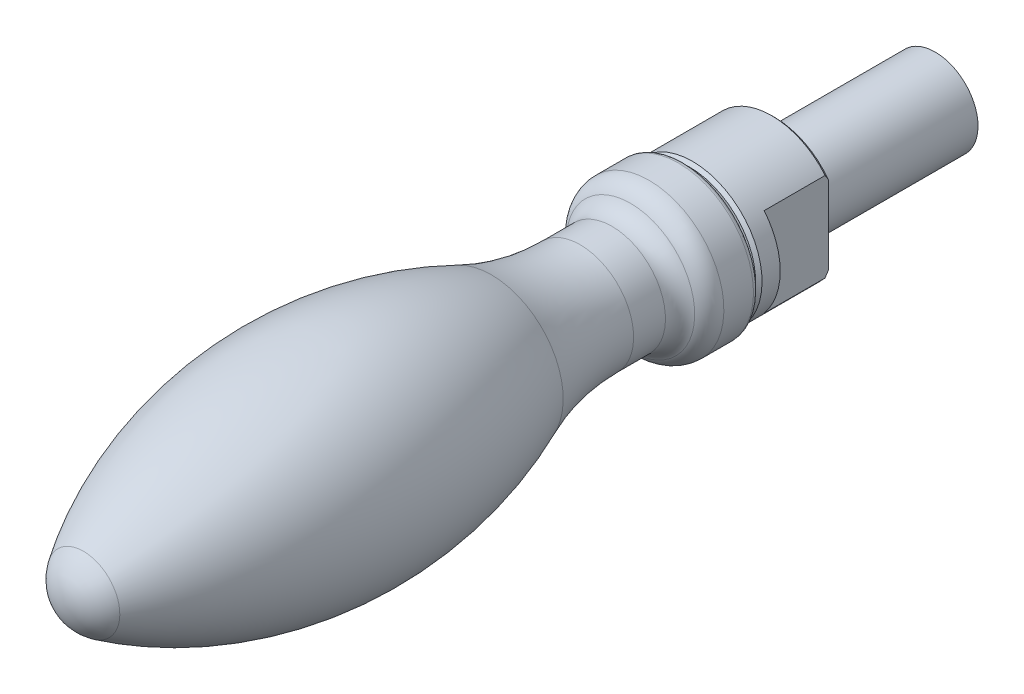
ISO-10303-21;
HEADER;
FILE_DESCRIPTION(('STEP AP214'),'2;1');
FILE_NAME('part.step','',(''),(''),'','','');
FILE_SCHEMA(('AUTOMOTIVE_DESIGN { 1 0 10303 214 1 1 1 1 }'));
ENDSEC;
DATA;
#1=APPLICATION_CONTEXT('core data for automotive mechanical design processes');
#2=APPLICATION_PROTOCOL_DEFINITION('international standard','automotive_design',2000,#1);
#3=PRODUCT_CONTEXT('',#1,'mechanical');
#4=PRODUCT('Part','Part','',(#3));
#5=PRODUCT_RELATED_PRODUCT_CATEGORY('part','',(#4));
#6=PRODUCT_DEFINITION_FORMATION('','',#4);
#7=PRODUCT_DEFINITION_CONTEXT('part definition',#1,'design');
#8=PRODUCT_DEFINITION('design','',#6,#7);
#9=PRODUCT_DEFINITION_SHAPE('','',#8);
#10=(LENGTH_UNIT() NAMED_UNIT(*) SI_UNIT(.MILLI.,.METRE.));
#11=(NAMED_UNIT(*) PLANE_ANGLE_UNIT() SI_UNIT($,.RADIAN.));
#12=(NAMED_UNIT(*) SI_UNIT($,.STERADIAN.) SOLID_ANGLE_UNIT());
#13=UNCERTAINTY_MEASURE_WITH_UNIT(LENGTH_MEASURE(1.E-05),#10,'distance_accuracy_value','');
#14=(GEOMETRIC_REPRESENTATION_CONTEXT(3) GLOBAL_UNCERTAINTY_ASSIGNED_CONTEXT((#13)) GLOBAL_UNIT_ASSIGNED_CONTEXT((#10,
#11,#12)) REPRESENTATION_CONTEXT('',''));
#15=CARTESIAN_POINT('',(0.,0.,0.));
#16=DIRECTION('',(0.,0.,1.));
#17=DIRECTION('',(1.,0.,0.));
#18=AXIS2_PLACEMENT_3D('',#15,#16,#17);
#19=CARTESIAN_POINT('',(0.,0.,-20.0000000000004));
#20=DIRECTION('',(0.,0.,-1.));
#21=DIRECTION('',(0.,1.,0.));
#22=AXIS2_PLACEMENT_3D('',#19,#20,#21);
#23=CYLINDRICAL_SURFACE('',#22,6.5);
#24=CARTESIAN_POINT('',(0.,0.,7.69999999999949));
#25=DIRECTION('',(0.,0.,-1.));
#26=DIRECTION('',(0.,1.,0.));
#27=AXIS2_PLACEMENT_3D('',#24,#25,#26);
#28=CIRCLE('',#27,6.5);
#29=CARTESIAN_POINT('',(0.,6.49999999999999,7.6999999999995));
#30=VERTEX_POINT('',#29);
#31=EDGE_CURVE('E224',#30,#30,#28,.T.);
#32=ORIENTED_EDGE('',*,*,#31,.T.);
#33=EDGE_LOOP('',(#32));
#34=FACE_BOUND('',#33,.T.);
#35=CARTESIAN_POINT('',(0.,0.,0.299999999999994));
#36=DIRECTION('',(0.,0.,-1.));
#37=DIRECTION('',(0.,1.,0.));
#38=AXIS2_PLACEMENT_3D('',#35,#36,#37);
#39=CIRCLE('',#38,6.5);
#40=CARTESIAN_POINT('',(-5.,4.15331193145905,0.299999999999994));
#41=VERTEX_POINT('',#40);
#42=CARTESIAN_POINT('',(5.,4.15331193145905,0.299999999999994));
#43=VERTEX_POINT('',#42);
#44=EDGE_CURVE('E84',#41,#43,#39,.T.);
#45=ORIENTED_EDGE('',*,*,#44,.F.);
#46=DIRECTION('',(0.,0.,-1.));
#47=VECTOR('',#46,1.);
#48=CARTESIAN_POINT('',(-5.,4.15331193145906,-20.0000000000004));
#49=LINE('',#48,#47);
#50=CARTESIAN_POINT('',(-5.,4.15331193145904,6.));
#51=VERTEX_POINT('',#50);
#52=EDGE_CURVE('E77',#41,#51,#49,.F.);
#53=ORIENTED_EDGE('',*,*,#52,.T.);
#54=CARTESIAN_POINT('',(0.,0.,6.));
#55=DIRECTION('',(0.,0.,1.));
#56=DIRECTION('',(0.,-1.,0.));
#57=AXIS2_PLACEMENT_3D('',#54,#55,#56);
#58=CIRCLE('',#57,6.5);
#59=CARTESIAN_POINT('',(-5.,-4.15331193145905,6.));
#60=VERTEX_POINT('',#59);
#61=EDGE_CURVE('E9',#60,#51,#58,.F.);
#62=ORIENTED_EDGE('',*,*,#61,.F.);
#63=DIRECTION('',(0.,0.,-1.));
#64=VECTOR('',#63,1.);
#65=CARTESIAN_POINT('',(-5.,-4.15331193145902,-20.0000000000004));
#66=LINE('',#65,#64);
#67=CARTESIAN_POINT('',(-5.,-4.15331193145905,0.299999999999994));
#68=VERTEX_POINT('',#67);
#69=EDGE_CURVE('E66',#60,#68,#66,.T.);
#70=ORIENTED_EDGE('',*,*,#69,.T.);
#71=CARTESIAN_POINT('',(5.,-4.15331193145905,0.299999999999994));
#72=VERTEX_POINT('',#71);
#73=EDGE_CURVE('E222',#72,#68,#39,.T.);
#74=ORIENTED_EDGE('',*,*,#73,.F.);
#75=DIRECTION('',(0.,0.,-1.));
#76=VECTOR('',#75,1.);
#77=CARTESIAN_POINT('',(5.,-4.15331193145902,-20.0000000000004));
#78=LINE('',#77,#76);
#79=CARTESIAN_POINT('',(5.,-4.15331193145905,6.));
#80=VERTEX_POINT('',#79);
#81=EDGE_CURVE('E239',#80,#72,#78,.T.);
#82=ORIENTED_EDGE('',*,*,#81,.F.);
#83=CARTESIAN_POINT('',(0.,0.,6.));
#84=DIRECTION('',(0.,0.,-1.));
#85=DIRECTION('',(0.,1.,0.));
#86=AXIS2_PLACEMENT_3D('',#83,#84,#85);
#87=CIRCLE('',#86,6.5);
#88=CARTESIAN_POINT('',(5.,4.15331193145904,6.));
#89=VERTEX_POINT('',#88);
#90=EDGE_CURVE('E202',#80,#89,#87,.F.);
#91=ORIENTED_EDGE('',*,*,#90,.T.);
#92=DIRECTION('',(0.,0.,-1.));
#93=VECTOR('',#92,1.);
#94=CARTESIAN_POINT('',(5.,4.15331193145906,-20.0000000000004));
#95=LINE('',#94,#93);
#96=EDGE_CURVE('E236',#43,#89,#95,.F.);
#97=ORIENTED_EDGE('',*,*,#96,.F.);
#98=EDGE_LOOP('',(#45,#53,#62,#70,#74,#82,#91,#97));
#99=FACE_BOUND('',#98,.T.);
#100=ADVANCED_FACE('F14',(#34,#99),#23,.T.);
#101=CARTESIAN_POINT('',(0.,0.,0.299999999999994));
#102=DIRECTION('',(0.,0.,1.));
#103=DIRECTION('',(0.,-1.,0.));
#104=AXIS2_PLACEMENT_3D('',#101,#102,#103);
#105=CONICAL_SURFACE('',#104,6.5,0.785398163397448);
#106=CARTESIAN_POINT('',(-5.,-1.41733011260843,-1.0029984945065));
#107=CARTESIAN_POINT('',(-5.,-1.5232809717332,-0.974105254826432));
#108=CARTESIAN_POINT('',(-5.,-1.62843384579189,-0.942427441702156));
#109=CARTESIAN_POINT('',(-5.,-1.83705617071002,-0.874112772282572));
#110=CARTESIAN_POINT('',(-5.,-1.94052652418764,-0.837478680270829));
#111=CARTESIAN_POINT('',(-5.,-2.24783021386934,-0.721240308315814));
#112=CARTESIAN_POINT('',(-5.,-2.44920407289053,-0.635116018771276));
#113=CARTESIAN_POINT('',(-5.,-2.84414976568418,-0.450309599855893));
#114=CARTESIAN_POINT('',(-5.,-3.03776846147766,-0.351725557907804));
#115=CARTESIAN_POINT('',(-5.,-3.41972953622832,-0.144523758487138));
#116=CARTESIAN_POINT('',(-5.,-3.60806738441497,-0.0358977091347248));
#117=CARTESIAN_POINT('',(-5.,-3.92476406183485,0.155545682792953));
#118=CARTESIAN_POINT('',(-5.,-4.05430320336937,0.236431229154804));
#119=CARTESIAN_POINT('',(-5.,-4.31135351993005,0.401368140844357));
#120=CARTESIAN_POINT('',(-5.,-4.43886462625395,0.485419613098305));
#121=CARTESIAN_POINT('',(-5.,-4.81878578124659,0.741583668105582));
#122=CARTESIAN_POINT('',(-5.,-5.06851875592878,0.917665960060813));
#123=CARTESIAN_POINT('',(-5.,-5.56272233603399,1.27765134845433));
#124=CARTESIAN_POINT('',(-5.,-5.80718574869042,1.46156422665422));
#125=CARTESIAN_POINT('',(-5.,-6.29174887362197,1.83506658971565));
#126=CARTESIAN_POINT('',(-5.,-6.53184829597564,2.02465644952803));
#127=CARTESIAN_POINT('',(-5.,-7.01412459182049,2.41260494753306));
#128=CARTESIAN_POINT('',(-5.,-7.25621963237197,2.61106497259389));
#129=CARTESIAN_POINT('',(-5.,-7.7375180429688,3.01148117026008));
#130=CARTESIAN_POINT('',(-5.,-7.97672124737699,3.21343754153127));
#131=CARTESIAN_POINT('',(-5.,-8.45178856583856,3.61924128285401));
#132=CARTESIAN_POINT('',(-5.,-8.6876624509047,3.82307723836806));
#133=CARTESIAN_POINT('',(-5.,-9.15745530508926,4.23292988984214));
#134=CARTESIAN_POINT('',(-5.,-9.39137452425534,4.43894629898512));
#135=CARTESIAN_POINT('',(-5.,-9.62453243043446,4.64581138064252));
#136=B_SPLINE_CURVE_WITH_KNOTS('',3,(#106,#107,#108,#109,#110,#111,#112,#113,#114,#115,#116,
#117,#118,#119,#120,#121,#122,#123,#124,#125,#126,#127,#128,#129,#130,#131,#132,#133,#134,#135),
.UNSPECIFIED.,.F.,.F.,(4,2,2,2,2,2,2,2,2,2,2,2,2,2,4),(0.,0.329363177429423,0.658543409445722,
1.31489081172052,1.96636021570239,2.61837243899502,3.07648154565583,3.5346061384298,
4.45108374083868,5.3687418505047,6.28646070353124,7.22555132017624,8.16469547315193,
9.09991885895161,10.0350207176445),.UNSPECIFIED.);
#137=CARTESIAN_POINT('',(-5.,-3.66606055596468,0.));
#138=VERTEX_POINT('',#137);
#139=EDGE_CURVE('E72',#138,#68,#136,.T.);
#140=ORIENTED_EDGE('',*,*,#139,.F.);
#141=CARTESIAN_POINT('',(0.,0.,0.));
#142=DIRECTION('',(0.,0.,-1.));
#143=DIRECTION('',(0.,1.,0.));
#144=AXIS2_PLACEMENT_3D('',#141,#142,#143);
#145=CIRCLE('',#144,6.2);
#146=CARTESIAN_POINT('',(5.,-3.66606055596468,0.));
#147=VERTEX_POINT('',#146);
#148=EDGE_CURVE('E213',#147,#138,#145,.T.);
#149=ORIENTED_EDGE('',*,*,#148,.F.);
#150=CARTESIAN_POINT('',(5.,-1.41733011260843,-1.0029984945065));
#151=CARTESIAN_POINT('',(5.,-1.5232809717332,-0.974105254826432));
#152=CARTESIAN_POINT('',(5.,-1.62843384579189,-0.942427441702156));
#153=CARTESIAN_POINT('',(5.,-1.83705617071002,-0.874112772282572));
#154=CARTESIAN_POINT('',(5.,-1.94052652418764,-0.837478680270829));
#155=CARTESIAN_POINT('',(5.,-2.24783021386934,-0.721240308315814));
#156=CARTESIAN_POINT('',(5.,-2.44920407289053,-0.635116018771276));
#157=CARTESIAN_POINT('',(5.,-2.84414976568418,-0.450309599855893));
#158=CARTESIAN_POINT('',(5.,-3.03776846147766,-0.351725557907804));
#159=CARTESIAN_POINT('',(5.,-3.41972953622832,-0.144523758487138));
#160=CARTESIAN_POINT('',(5.,-3.60806738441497,-0.0358977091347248));
#161=CARTESIAN_POINT('',(5.,-3.92476406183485,0.155545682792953));
#162=CARTESIAN_POINT('',(5.,-4.05430320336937,0.236431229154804));
#163=CARTESIAN_POINT('',(5.,-4.31135351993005,0.401368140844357));
#164=CARTESIAN_POINT('',(5.,-4.43886462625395,0.485419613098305));
#165=CARTESIAN_POINT('',(5.,-4.81878578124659,0.741583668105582));
#166=CARTESIAN_POINT('',(5.,-5.06851875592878,0.917665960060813));
#167=CARTESIAN_POINT('',(5.,-5.56272233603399,1.27765134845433));
#168=CARTESIAN_POINT('',(5.,-5.80718574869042,1.46156422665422));
#169=CARTESIAN_POINT('',(5.,-6.29174887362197,1.83506658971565));
#170=CARTESIAN_POINT('',(5.,-6.53184829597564,2.02465644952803));
#171=CARTESIAN_POINT('',(5.,-7.01412459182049,2.41260494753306));
#172=CARTESIAN_POINT('',(5.,-7.25621963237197,2.61106497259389));
#173=CARTESIAN_POINT('',(5.,-7.7375180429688,3.01148117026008));
#174=CARTESIAN_POINT('',(5.,-7.97672124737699,3.21343754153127));
#175=CARTESIAN_POINT('',(5.,-8.45178856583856,3.61924128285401));
#176=CARTESIAN_POINT('',(5.,-8.6876624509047,3.82307723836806));
#177=CARTESIAN_POINT('',(5.,-9.15745530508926,4.23292988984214));
#178=CARTESIAN_POINT('',(5.,-9.39137452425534,4.43894629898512));
#179=CARTESIAN_POINT('',(5.,-9.62453243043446,4.64581138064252));
#180=B_SPLINE_CURVE_WITH_KNOTS('',3,(#150,#151,#152,#153,#154,#155,#156,#157,#158,#159,#160,
#161,#162,#163,#164,#165,#166,#167,#168,#169,#170,#171,#172,#173,#174,#175,#176,#177,#178,#179),
.UNSPECIFIED.,.F.,.F.,(4,2,2,2,2,2,2,2,2,2,2,2,2,2,4),(0.,0.329363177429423,0.658543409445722,
1.31489081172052,1.96636021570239,2.61837243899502,3.07648154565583,3.5346061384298,
4.45108374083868,5.3687418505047,6.28646070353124,7.22555132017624,8.16469547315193,
9.09991885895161,10.0350207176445),.UNSPECIFIED.);
#181=EDGE_CURVE('E37',#147,#72,#180,.T.);
#182=ORIENTED_EDGE('',*,*,#181,.T.);
#183=ORIENTED_EDGE('',*,*,#73,.T.);
#184=EDGE_LOOP('',(#140,#149,#182,#183));
#185=FACE_BOUND('',#184,.T.);
#186=ADVANCED_FACE('F105',(#185),#105,.T.);
#187=CARTESIAN_POINT('',(-5.,9.62453243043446,4.64581138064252));
#188=CARTESIAN_POINT('',(-5.,9.39137452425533,4.43894629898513));
#189=CARTESIAN_POINT('',(-5.,9.15745530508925,4.23292988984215));
#190=CARTESIAN_POINT('',(-5.,8.68766245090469,3.82307723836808));
#191=CARTESIAN_POINT('',(-5.,8.45178856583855,3.61924128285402));
#192=CARTESIAN_POINT('',(-5.,7.97672124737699,3.21343754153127));
#193=CARTESIAN_POINT('',(-5.,7.7375180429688,3.01148117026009));
#194=CARTESIAN_POINT('',(-5.,7.25621963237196,2.61106497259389));
#195=CARTESIAN_POINT('',(-5.,7.01412459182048,2.41260494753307));
#196=CARTESIAN_POINT('',(-5.,6.53184829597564,2.02465644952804));
#197=CARTESIAN_POINT('',(-5.,6.29174887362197,1.83506658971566));
#198=CARTESIAN_POINT('',(-5.,5.80718574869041,1.46156422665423));
#199=CARTESIAN_POINT('',(-5.,5.56272233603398,1.27765134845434));
#200=CARTESIAN_POINT('',(-5.,5.06851875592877,0.917665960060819));
#201=CARTESIAN_POINT('',(-5.,4.81878578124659,0.741583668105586));
#202=CARTESIAN_POINT('',(-5.,4.43886462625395,0.48541961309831));
#203=CARTESIAN_POINT('',(-5.,4.31135351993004,0.401368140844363));
#204=CARTESIAN_POINT('',(-5.,4.05430320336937,0.236431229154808));
#205=CARTESIAN_POINT('',(-5.,3.92476406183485,0.155545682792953));
#206=CARTESIAN_POINT('',(-5.,3.60806738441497,-0.0358977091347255));
#207=CARTESIAN_POINT('',(-5.,3.41972953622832,-0.144523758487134));
#208=CARTESIAN_POINT('',(-5.,3.03776846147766,-0.351725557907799));
#209=CARTESIAN_POINT('',(-5.,2.84414976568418,-0.450309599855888));
#210=CARTESIAN_POINT('',(-5.,2.44920407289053,-0.635116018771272));
#211=CARTESIAN_POINT('',(-5.,2.24783021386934,-0.72124030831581));
#212=CARTESIAN_POINT('',(-5.,1.94052652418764,-0.837478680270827));
#213=CARTESIAN_POINT('',(-5.,1.83705617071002,-0.87411277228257));
#214=CARTESIAN_POINT('',(-5.,1.62843384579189,-0.942427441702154));
#215=CARTESIAN_POINT('',(-5.,1.52328097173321,-0.974105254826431));
#216=CARTESIAN_POINT('',(-5.,1.41733011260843,-1.0029984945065));
#217=B_SPLINE_CURVE_WITH_KNOTS('',3,(#187,#188,#189,#190,#191,#192,#193,#194,#195,#196,#197,
#198,#199,#200,#201,#202,#203,#204,#205,#206,#207,#208,#209,#210,#211,#212,#213,#214,#215,#216),
.UNSPECIFIED.,.F.,.F.,(4,2,2,2,2,2,2,2,2,2,2,2,2,2,4),(0.,0.935101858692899,1.87032524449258,
2.80946939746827,3.74856001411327,4.66627886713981,5.58393697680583,6.5004145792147,
6.95853917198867,7.41664827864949,8.06866050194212,8.72012990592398,9.37647730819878,
9.70565754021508,10.0350207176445),.UNSPECIFIED.);
#218=CARTESIAN_POINT('',(-5.,3.66606055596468,0.));
#219=VERTEX_POINT('',#218);
#220=EDGE_CURVE('E29',#41,#219,#217,.T.);
#221=ORIENTED_EDGE('',*,*,#220,.F.);
#222=ORIENTED_EDGE('',*,*,#44,.T.);
#223=CARTESIAN_POINT('',(5.,9.62453243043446,4.64581138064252));
#224=CARTESIAN_POINT('',(5.,9.39137452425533,4.43894629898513));
#225=CARTESIAN_POINT('',(5.,9.15745530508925,4.23292988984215));
#226=CARTESIAN_POINT('',(5.,8.68766245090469,3.82307723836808));
#227=CARTESIAN_POINT('',(5.,8.45178856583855,3.61924128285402));
#228=CARTESIAN_POINT('',(5.,7.97672124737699,3.21343754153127));
#229=CARTESIAN_POINT('',(5.,7.7375180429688,3.01148117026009));
#230=CARTESIAN_POINT('',(5.,7.25621963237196,2.61106497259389));
#231=CARTESIAN_POINT('',(5.,7.01412459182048,2.41260494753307));
#232=CARTESIAN_POINT('',(5.,6.53184829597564,2.02465644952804));
#233=CARTESIAN_POINT('',(5.,6.29174887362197,1.83506658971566));
#234=CARTESIAN_POINT('',(5.,5.80718574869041,1.46156422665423));
#235=CARTESIAN_POINT('',(5.,5.56272233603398,1.27765134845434));
#236=CARTESIAN_POINT('',(5.,5.06851875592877,0.917665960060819));
#237=CARTESIAN_POINT('',(5.,4.81878578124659,0.741583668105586));
#238=CARTESIAN_POINT('',(5.,4.43886462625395,0.48541961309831));
#239=CARTESIAN_POINT('',(5.,4.31135351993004,0.401368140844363));
#240=CARTESIAN_POINT('',(5.,4.05430320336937,0.236431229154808));
#241=CARTESIAN_POINT('',(5.,3.92476406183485,0.155545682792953));
#242=CARTESIAN_POINT('',(5.,3.60806738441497,-0.0358977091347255));
#243=CARTESIAN_POINT('',(5.,3.41972953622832,-0.144523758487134));
#244=CARTESIAN_POINT('',(5.,3.03776846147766,-0.351725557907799));
#245=CARTESIAN_POINT('',(5.,2.84414976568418,-0.450309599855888));
#246=CARTESIAN_POINT('',(5.,2.44920407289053,-0.635116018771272));
#247=CARTESIAN_POINT('',(5.,2.24783021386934,-0.72124030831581));
#248=CARTESIAN_POINT('',(5.,1.94052652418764,-0.837478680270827));
#249=CARTESIAN_POINT('',(5.,1.83705617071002,-0.87411277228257));
#250=CARTESIAN_POINT('',(5.,1.62843384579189,-0.942427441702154));
#251=CARTESIAN_POINT('',(5.,1.52328097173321,-0.974105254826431));
#252=CARTESIAN_POINT('',(5.,1.41733011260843,-1.0029984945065));
#253=B_SPLINE_CURVE_WITH_KNOTS('',3,(#223,#224,#225,#226,#227,#228,#229,#230,#231,#232,#233,
#234,#235,#236,#237,#238,#239,#240,#241,#242,#243,#244,#245,#246,#247,#248,#249,#250,#251,#252),
.UNSPECIFIED.,.F.,.F.,(4,2,2,2,2,2,2,2,2,2,2,2,2,2,4),(0.,0.935101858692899,1.87032524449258,
2.80946939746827,3.74856001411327,4.66627886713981,5.58393697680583,6.5004145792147,
6.95853917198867,7.41664827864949,8.06866050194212,8.72012990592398,9.37647730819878,
9.70565754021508,10.0350207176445),.UNSPECIFIED.);
#254=CARTESIAN_POINT('',(5.,3.66606055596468,0.));
#255=VERTEX_POINT('',#254);
#256=EDGE_CURVE('E88',#43,#255,#253,.T.);
#257=ORIENTED_EDGE('',*,*,#256,.T.);
#258=EDGE_CURVE('E211',#219,#255,#145,.T.);
#259=ORIENTED_EDGE('',*,*,#258,.F.);
#260=EDGE_LOOP('',(#221,#222,#257,#259));
#261=FACE_BOUND('',#260,.T.);
#262=ADVANCED_FACE('F159',(#261),#105,.T.);
#263=CARTESIAN_POINT('',(4.,0.,0.));
#264=DIRECTION('',(0.,0.,-1.));
#265=DIRECTION('',(0.,1.,0.));
#266=AXIS2_PLACEMENT_3D('',#263,#264,#265);
#267=PLANE('',#266);
#268=CARTESIAN_POINT('',(0.,0.,0.));
#269=DIRECTION('',(0.,0.,-1.));
#270=DIRECTION('',(0.,1.,0.));
#271=AXIS2_PLACEMENT_3D('',#268,#269,#270);
#272=CIRCLE('',#271,4.);
#273=CARTESIAN_POINT('',(0.,4.,0.));
#274=VERTEX_POINT('',#273);
#275=EDGE_CURVE('E215',#274,#274,#272,.T.);
#276=ORIENTED_EDGE('',*,*,#275,.F.);
#277=EDGE_LOOP('',(#276));
#278=FACE_BOUND('',#277,.T.);
#279=ORIENTED_EDGE('',*,*,#148,.T.);
#280=DIRECTION('',(0.,1.,0.));
#281=VECTOR('',#280,1.);
#282=CARTESIAN_POINT('',(-5.,0.,0.));
#283=LINE('',#282,#281);
#284=EDGE_CURVE('E22',#138,#219,#283,.T.);
#285=ORIENTED_EDGE('',*,*,#284,.T.);
#286=ORIENTED_EDGE('',*,*,#258,.T.);
#287=DIRECTION('',(0.,1.,0.));
#288=VECTOR('',#287,1.);
#289=CARTESIAN_POINT('',(5.,0.,0.));
#290=LINE('',#289,#288);
#291=EDGE_CURVE('E200',#147,#255,#290,.T.);
#292=ORIENTED_EDGE('',*,*,#291,.F.);
#293=EDGE_LOOP('',(#279,#285,#286,#292));
#294=FACE_BOUND('',#293,.T.);
#295=ADVANCED_FACE('F157',(#278,#294),#267,.T.);
#296=CARTESIAN_POINT('',(0.,0.,8.99999999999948));
#297=DIRECTION('',(0.,0.,-1.));
#298=DIRECTION('',(0.,1.,0.));
#299=AXIS2_PLACEMENT_3D('',#296,#297,#298);
#300=TOROIDAL_SURFACE('',#299,6.5,0.5);
#301=CARTESIAN_POINT('',(0.,0.,8.49999999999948));
#302=DIRECTION('',(0.,0.,-1.));
#303=DIRECTION('',(0.,1.,0.));
#304=AXIS2_PLACEMENT_3D('',#301,#302,#303);
#305=CIRCLE('',#304,6.5);
#306=CARTESIAN_POINT('',(0.,6.49999999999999,8.49999999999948));
#307=VERTEX_POINT('',#306);
#308=EDGE_CURVE('E199',#307,#307,#305,.T.);
#309=ORIENTED_EDGE('',*,*,#308,.F.);
#310=EDGE_LOOP('',(#309));
#311=FACE_BOUND('',#310,.T.);
#312=CARTESIAN_POINT('',(0.,0.,8.99999999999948));
#313=DIRECTION('',(0.,0.,-1.));
#314=DIRECTION('',(0.,1.,0.));
#315=AXIS2_PLACEMENT_3D('',#312,#313,#314);
#316=CIRCLE('',#315,7.);
#317=CARTESIAN_POINT('',(0.,6.99999999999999,8.99999999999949));
#318=VERTEX_POINT('',#317);
#319=EDGE_CURVE('E238',#318,#318,#316,.T.);
#320=ORIENTED_EDGE('',*,*,#319,.T.);
#321=EDGE_LOOP('',(#320));
#322=FACE_BOUND('',#321,.T.);
#323=ADVANCED_FACE('F16',(#311,#322),#300,.T.);
#324=CARTESIAN_POINT('',(6.5,0.,8.49999999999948));
#325=DIRECTION('',(0.,0.,1.));
#326=DIRECTION('',(0.,-1.,0.));
#327=AXIS2_PLACEMENT_3D('',#324,#325,#326);
#328=PLANE('',#327);
#329=CARTESIAN_POINT('',(0.,0.,8.50000000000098));
#330=DIRECTION('',(0.,0.,-1.));
#331=DIRECTION('',(0.,1.,0.));
#332=AXIS2_PLACEMENT_3D('',#329,#330,#331);
#333=CIRCLE('',#332,2.91270166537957);
#334=CARTESIAN_POINT('',(0.,2.91270166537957,8.50000000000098));
#335=VERTEX_POINT('',#334);
#336=EDGE_CURVE('E196',#335,#335,#333,.T.);
#337=ORIENTED_EDGE('',*,*,#336,.F.);
#338=EDGE_LOOP('',(#337));
#339=FACE_BOUND('',#338,.T.);
#340=ORIENTED_EDGE('',*,*,#308,.T.);
#341=EDGE_LOOP('',(#340));
#342=FACE_BOUND('',#341,.T.);
#343=ADVANCED_FACE('F166',(#339,#342),#328,.F.);
#344=CARTESIAN_POINT('',(0.,0.,8.39999999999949));
#345=DIRECTION('',(0.,0.,-1.));
#346=DIRECTION('',(0.,1.,0.));
#347=AXIS2_PLACEMENT_3D('',#344,#345,#346);
#348=TOROIDAL_SURFACE('',#347,3.3,0.4);
#349=ORIENTED_EDGE('',*,*,#336,.T.);
#350=EDGE_LOOP('',(#349));
#351=FACE_BOUND('',#350,.T.);
#352=CARTESIAN_POINT('',(0.,0.,7.99999999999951));
#353=DIRECTION('',(0.,0.,-1.));
#354=DIRECTION('',(0.,1.,0.));
#355=AXIS2_PLACEMENT_3D('',#352,#353,#354);
#356=CIRCLE('',#355,3.3);
#357=CARTESIAN_POINT('',(0.,3.29999999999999,7.99999999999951));
#358=VERTEX_POINT('',#357);
#359=EDGE_CURVE('E204',#358,#358,#356,.T.);
#360=ORIENTED_EDGE('',*,*,#359,.F.);
#361=EDGE_LOOP('',(#360));
#362=FACE_BOUND('',#361,.T.);
#363=ADVANCED_FACE('F185',(#351,#362),#348,.F.);
#364=CARTESIAN_POINT('',(3.3,0.,7.99999999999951));
#365=DIRECTION('',(0.,0.,-1.));
#366=DIRECTION('',(0.,1.,0.));
#367=AXIS2_PLACEMENT_3D('',#364,#365,#366);
#368=PLANE('',#367);
#369=CARTESIAN_POINT('',(0.,0.,8.));
#370=DIRECTION('',(0.,0.,-1.));
#371=DIRECTION('',(0.,1.,0.));
#372=AXIS2_PLACEMENT_3D('',#369,#370,#371);
#373=CIRCLE('',#372,6.2);
#374=CARTESIAN_POINT('',(0.,6.19999999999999,8.00000000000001));
#375=VERTEX_POINT('',#374);
#376=EDGE_CURVE('E226',#375,#375,#373,.T.);
#377=ORIENTED_EDGE('',*,*,#376,.F.);
#378=EDGE_LOOP('',(#377));
#379=FACE_BOUND('',#378,.T.);
#380=ORIENTED_EDGE('',*,*,#359,.T.);
#381=EDGE_LOOP('',(#380));
#382=FACE_BOUND('',#381,.T.);
#383=ADVANCED_FACE('F181',(#379,#382),#368,.F.);
#384=CARTESIAN_POINT('',(0.,0.,7.69999999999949));
#385=DIRECTION('',(0.,0.,-1.));
#386=DIRECTION('',(0.,1.,0.));
#387=AXIS2_PLACEMENT_3D('',#384,#385,#386);
#388=CONICAL_SURFACE('',#387,6.5,0.785398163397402);
#389=ORIENTED_EDGE('',*,*,#376,.T.);
#390=EDGE_LOOP('',(#389));
#391=FACE_BOUND('',#390,.T.);
#392=ORIENTED_EDGE('',*,*,#31,.F.);
#393=EDGE_LOOP('',(#392));
#394=FACE_BOUND('',#393,.T.);
#395=ADVANCED_FACE('F155',(#391,#394),#388,.T.);
#396=CARTESIAN_POINT('',(0.,0.,-20.0000000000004));
#397=DIRECTION('',(0.,0.,-1.));
#398=DIRECTION('',(0.,1.,0.));
#399=AXIS2_PLACEMENT_3D('',#396,#397,#398);
#400=CYLINDRICAL_SURFACE('',#399,4.);
#401=ORIENTED_EDGE('',*,*,#275,.T.);
#402=EDGE_LOOP('',(#401));
#403=FACE_BOUND('',#402,.T.);
#404=CARTESIAN_POINT('',(0.,0.,-15.));
#405=DIRECTION('',(0.,0.,-1.));
#406=DIRECTION('',(0.,1.,0.));
#407=AXIS2_PLACEMENT_3D('',#404,#405,#406);
#408=CIRCLE('',#407,4.);
#409=CARTESIAN_POINT('',(0.,4.00000000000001,-15.));
#410=VERTEX_POINT('',#409);
#411=EDGE_CURVE('E218',#410,#410,#408,.T.);
#412=ORIENTED_EDGE('',*,*,#411,.F.);
#413=EDGE_LOOP('',(#412));
#414=FACE_BOUND('',#413,.T.);
#415=ADVANCED_FACE('F152',(#403,#414),#400,.T.);
#416=CARTESIAN_POINT('',(0.,0.,-15.0000000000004));
#417=DIRECTION('',(0.,0.,-1.));
#418=DIRECTION('',(0.,1.,0.));
#419=AXIS2_PLACEMENT_3D('',#416,#417,#418);
#420=PLANE('',#419);
#421=ORIENTED_EDGE('',*,*,#411,.T.);
#422=EDGE_LOOP('',(#421));
#423=FACE_BOUND('',#422,.T.);
#424=ADVANCED_FACE('F148',(#423),#420,.T.);
#425=CARTESIAN_POINT('',(0.,0.,62.4393939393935));
#426=DIRECTION('',(0.,1.,0.));
#427=DIRECTION('',(0.,0.,1.));
#428=AXIS2_PLACEMENT_3D('',#425,#426,#427);
#429=SPHERICAL_SURFACE('',#428,4.06060606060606);
#430=CARTESIAN_POINT('',(0.,0.,62.4393939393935));
#431=DIRECTION('',(0.,0.,-1.));
#432=DIRECTION('',(0.,1.,0.));
#433=AXIS2_PLACEMENT_3D('',#430,#431,#432);
#434=SPHERICAL_SURFACE('',#433,4.06060606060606);
#435=CARTESIAN_POINT('',(0.,0.,64.6613305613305));
#436=DIRECTION('',(0.,0.,-1.));
#437=DIRECTION('',(0.,1.,0.));
#438=AXIS2_PLACEMENT_3D('',#435,#436,#437);
#439=CIRCLE('',#438,3.39875259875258);
#440=CARTESIAN_POINT('',(0.,3.39875259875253,64.6613305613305));
#441=VERTEX_POINT('',#440);
#442=EDGE_CURVE('E259',#441,#441,#439,.T.);
#443=ORIENTED_EDGE('',*,*,#442,.F.);
#444=EDGE_LOOP('',(#443));
#445=FACE_BOUND('',#444,.T.);
#446=ADVANCED_FACE('F144',(#445),#434,.T.);
#447=CARTESIAN_POINT('',(0.,0.,42.4999999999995));
#448=DIRECTION('',(0.,0.,-1.));
#449=DIRECTION('',(0.,1.,0.));
#450=AXIS2_PLACEMENT_3D('',#447,#448,#449);
#451=DEGENERATE_TOROIDAL_SURFACE('',#450,30.5,40.5,.F.);
#452=CARTESIAN_POINT('',(0.,0.,26.504201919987));
#453=DIRECTION('',(0.,0.,-1.));
#454=DIRECTION('',(0.,1.,0.));
#455=AXIS2_PLACEMENT_3D('',#452,#453,#454);
#456=CIRCLE('',#455,6.70731707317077);
#457=CARTESIAN_POINT('',(0.,6.70731707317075,26.504201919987));
#458=VERTEX_POINT('',#457);
#459=EDGE_CURVE('E256',#458,#458,#456,.T.);
#460=ORIENTED_EDGE('',*,*,#459,.F.);
#461=EDGE_LOOP('',(#460));
#462=FACE_BOUND('',#461,.T.);
#463=ORIENTED_EDGE('',*,*,#442,.T.);
#464=EDGE_LOOP('',(#463));
#465=FACE_BOUND('',#464,.T.);
#466=ADVANCED_FACE('F140',(#462,#465),#451,.F.);
#467=CARTESIAN_POINT('',(0.,0.,18.2100843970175));
#468=DIRECTION('',(0.,0.,-1.));
#469=DIRECTION('',(0.,1.,0.));
#470=AXIS2_PLACEMENT_3D('',#467,#468,#469);
#471=TOROIDAL_SURFACE('',#470,26.,21.);
#472=ORIENTED_EDGE('',*,*,#459,.T.);
#473=EDGE_LOOP('',(#472));
#474=FACE_BOUND('',#473,.T.);
#475=CARTESIAN_POINT('',(0.,0.,18.2100843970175));
#476=DIRECTION('',(0.,0.,-1.));
#477=DIRECTION('',(0.,1.,0.));
#478=AXIS2_PLACEMENT_3D('',#475,#476,#477);
#479=CIRCLE('',#478,5.00000000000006);
#480=CARTESIAN_POINT('',(0.,5.00000000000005,18.2100843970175));
#481=VERTEX_POINT('',#480);
#482=EDGE_CURVE('E253',#481,#481,#479,.T.);
#483=ORIENTED_EDGE('',*,*,#482,.F.);
#484=EDGE_LOOP('',(#483));
#485=FACE_BOUND('',#484,.T.);
#486=ADVANCED_FACE('F136',(#474,#485),#471,.F.);
#487=CARTESIAN_POINT('',(0.,0.,-20.0000000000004));
#488=DIRECTION('',(0.,0.,-1.));
#489=DIRECTION('',(0.,1.,0.));
#490=AXIS2_PLACEMENT_3D('',#487,#488,#489);
#491=CYLINDRICAL_SURFACE('',#490,5.);
#492=ORIENTED_EDGE('',*,*,#482,.T.);
#493=EDGE_LOOP('',(#492));
#494=FACE_BOUND('',#493,.T.);
#495=CARTESIAN_POINT('',(0.,0.,15.2320508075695));
#496=DIRECTION('',(0.,0.,-1.));
#497=DIRECTION('',(0.,1.,0.));
#498=AXIS2_PLACEMENT_3D('',#495,#496,#497);
#499=CIRCLE('',#498,5.);
#500=CARTESIAN_POINT('',(0.,4.99999999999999,15.2320508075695));
#501=VERTEX_POINT('',#500);
#502=EDGE_CURVE('E250',#501,#501,#499,.T.);
#503=ORIENTED_EDGE('',*,*,#502,.F.);
#504=EDGE_LOOP('',(#503));
#505=FACE_BOUND('',#504,.T.);
#506=ADVANCED_FACE('F132',(#494,#505),#491,.T.);
#507=CARTESIAN_POINT('',(0.,0.,15.2320508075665));
#508=DIRECTION('',(0.,0.,-1.));
#509=DIRECTION('',(0.,1.,0.));
#510=AXIS2_PLACEMENT_3D('',#507,#508,#509);
#511=TOROIDAL_SURFACE('',#510,7.,2.);
#512=ORIENTED_EDGE('',*,*,#502,.T.);
#513=EDGE_LOOP('',(#512));
#514=FACE_BOUND('',#513,.T.);
#515=CARTESIAN_POINT('',(0.,0.,13.5));
#516=DIRECTION('',(0.,0.,-1.));
#517=DIRECTION('',(0.,1.,0.));
#518=AXIS2_PLACEMENT_3D('',#515,#516,#517);
#519=CIRCLE('',#518,5.99999999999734);
#520=CARTESIAN_POINT('',(0.,5.99999999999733,13.5));
#521=VERTEX_POINT('',#520);
#522=EDGE_CURVE('E247',#521,#521,#519,.T.);
#523=ORIENTED_EDGE('',*,*,#522,.F.);
#524=EDGE_LOOP('',(#523));
#525=FACE_BOUND('',#524,.T.);
#526=ADVANCED_FACE('F128',(#514,#525),#511,.F.);
#527=CARTESIAN_POINT('',(0.,0.,11.7679491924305));
#528=DIRECTION('',(0.,0.,-1.));
#529=DIRECTION('',(0.,1.,0.));
#530=AXIS2_PLACEMENT_3D('',#527,#528,#529);
#531=TOROIDAL_SURFACE('',#530,5.,1.99999999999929);
#532=CARTESIAN_POINT('',(0.,0.,11.767949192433));
#533=DIRECTION('',(0.,0.,-1.));
#534=DIRECTION('',(0.,1.,0.));
#535=AXIS2_PLACEMENT_3D('',#532,#533,#534);
#536=CIRCLE('',#535,7.);
#537=CARTESIAN_POINT('',(0.,6.99999999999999,11.767949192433));
#538=VERTEX_POINT('',#537);
#539=EDGE_CURVE('E242',#538,#538,#536,.T.);
#540=ORIENTED_EDGE('',*,*,#539,.F.);
#541=EDGE_LOOP('',(#540));
#542=FACE_BOUND('',#541,.T.);
#543=ORIENTED_EDGE('',*,*,#522,.T.);
#544=EDGE_LOOP('',(#543));
#545=FACE_BOUND('',#544,.T.);
#546=ADVANCED_FACE('F124',(#542,#545),#531,.T.);
#547=CARTESIAN_POINT('',(0.,0.,-20.0000000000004));
#548=DIRECTION('',(0.,0.,-1.));
#549=DIRECTION('',(0.,1.,0.));
#550=AXIS2_PLACEMENT_3D('',#547,#548,#549);
#551=CYLINDRICAL_SURFACE('',#550,7.);
#552=ORIENTED_EDGE('',*,*,#539,.T.);
#553=EDGE_LOOP('',(#552));
#554=FACE_BOUND('',#553,.T.);
#555=ORIENTED_EDGE('',*,*,#319,.F.);
#556=EDGE_LOOP('',(#555));
#557=FACE_BOUND('',#556,.T.);
#558=ADVANCED_FACE('F120',(#554,#557),#551,.T.);
#559=CARTESIAN_POINT('',(8.33044124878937,-5.,6.));
#560=DIRECTION('',(0.,0.,-1.));
#561=DIRECTION('',(0.,1.,0.));
#562=AXIS2_PLACEMENT_3D('',#559,#560,#561);
#563=PLANE('',#562);
#564=DIRECTION('',(0.,1.,0.));
#565=VECTOR('',#564,1.);
#566=CARTESIAN_POINT('',(5.,-5.,6.));
#567=LINE('',#566,#565);
#568=EDGE_CURVE('E85',#80,#89,#567,.T.);
#569=ORIENTED_EDGE('',*,*,#568,.T.);
#570=ORIENTED_EDGE('',*,*,#90,.F.);
#571=EDGE_LOOP('',(#569,#570));
#572=FACE_BOUND('',#571,.T.);
#573=ADVANCED_FACE('F114',(#572),#563,.T.);
#574=CARTESIAN_POINT('',(5.,-5.,-1.77879563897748));
#575=DIRECTION('',(-1.,0.,0.));
#576=DIRECTION('',(0.,-1.,0.));
#577=AXIS2_PLACEMENT_3D('',#574,#575,#576);
#578=PLANE('',#577);
#579=ORIENTED_EDGE('',*,*,#96,.T.);
#580=ORIENTED_EDGE('',*,*,#568,.F.);
#581=ORIENTED_EDGE('',*,*,#81,.T.);
#582=ORIENTED_EDGE('',*,*,#181,.F.);
#583=ORIENTED_EDGE('',*,*,#291,.T.);
#584=ORIENTED_EDGE('',*,*,#256,.F.);
#585=EDGE_LOOP('',(#579,#580,#581,#582,#583,#584));
#586=FACE_BOUND('',#585,.T.);
#587=ADVANCED_FACE('F109',(#586),#578,.F.);
#588=CARTESIAN_POINT('',(-5.,-5.,-1.77879563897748));
#589=DIRECTION('',(-1.,0.,0.));
#590=DIRECTION('',(0.,-1.,0.));
#591=AXIS2_PLACEMENT_3D('',#588,#589,#590);
#592=PLANE('',#591);
#593=ORIENTED_EDGE('',*,*,#220,.T.);
#594=ORIENTED_EDGE('',*,*,#284,.F.);
#595=ORIENTED_EDGE('',*,*,#139,.T.);
#596=ORIENTED_EDGE('',*,*,#69,.F.);
#597=DIRECTION('',(0.,1.,0.));
#598=VECTOR('',#597,1.);
#599=CARTESIAN_POINT('',(-5.,-5.,6.));
#600=LINE('',#599,#598);
#601=EDGE_CURVE('E69',#60,#51,#600,.T.);
#602=ORIENTED_EDGE('',*,*,#601,.T.);
#603=ORIENTED_EDGE('',*,*,#52,.F.);
#604=EDGE_LOOP('',(#593,#594,#595,#596,#602,#603));
#605=FACE_BOUND('',#604,.T.);
#606=ADVANCED_FACE('F68',(#605),#592,.T.);
#607=CARTESIAN_POINT('',(-8.33044124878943,-5.,6.));
#608=DIRECTION('',(0.,0.,1.));
#609=DIRECTION('',(0.,-1.,0.));
#610=AXIS2_PLACEMENT_3D('',#607,#608,#609);
#611=PLANE('',#610);
#612=ORIENTED_EDGE('',*,*,#61,.T.);
#613=ORIENTED_EDGE('',*,*,#601,.F.);
#614=EDGE_LOOP('',(#612,#613));
#615=FACE_BOUND('',#614,.T.);
#616=ADVANCED_FACE('F80',(#615),#611,.F.);
#617=CLOSED_SHELL('',(#100,#186,#262,#295,#323,#343,#363,#383,#395,#415,#424,#446,#466,#486,
#506,#526,#546,#558,#573,#587,#606,#616));
#618=MANIFOLD_SOLID_BREP('B1',#617);
#619=ADVANCED_BREP_SHAPE_REPRESENTATION('',(#18,#618),#14);
#620=SHAPE_DEFINITION_REPRESENTATION(#9,#619);
ENDSEC;
END-ISO-10303-21;
